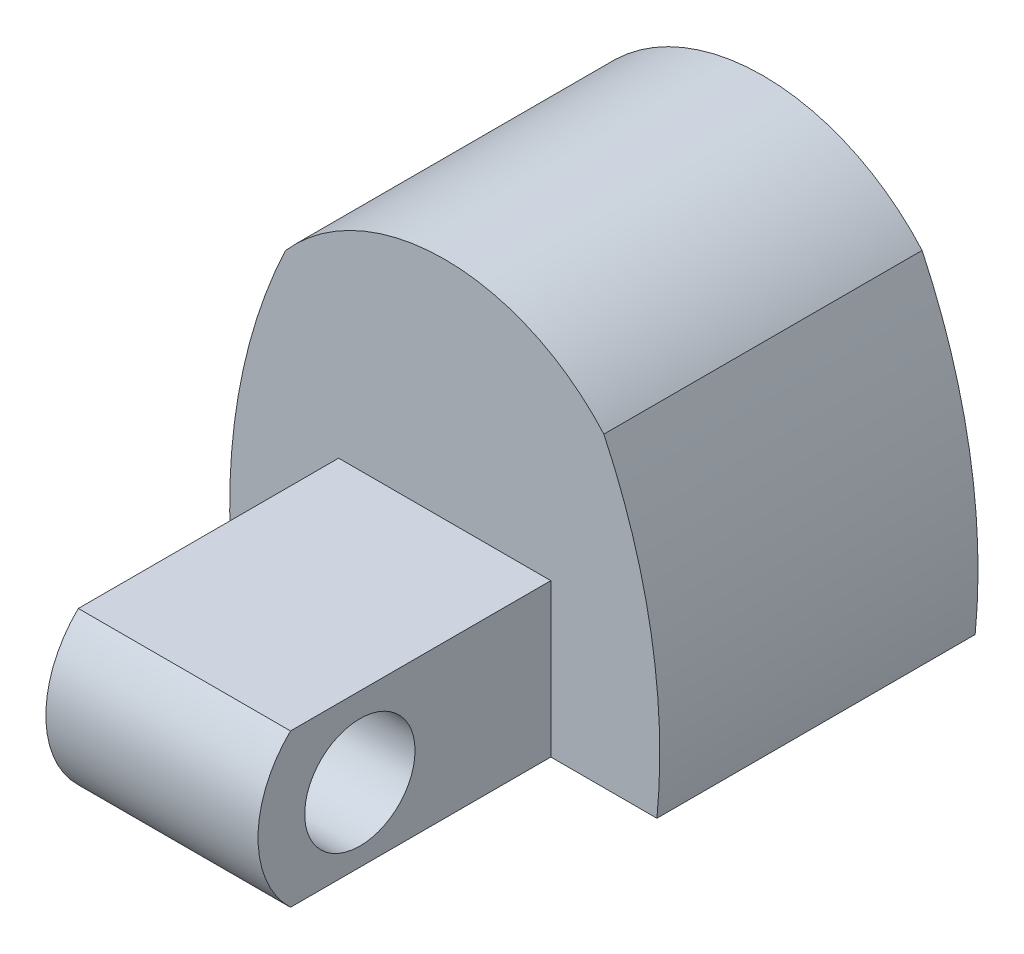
ISO-10303-21;
HEADER;
FILE_DESCRIPTION(('STEP AP214'),'2;1');
FILE_NAME('part.step','',(''),(''),'','','');
FILE_SCHEMA(('AUTOMOTIVE_DESIGN { 1 0 10303 214 1 1 1 1 }'));
ENDSEC;
DATA;
#1=APPLICATION_CONTEXT('core data for automotive mechanical design processes');
#2=APPLICATION_PROTOCOL_DEFINITION('international standard','automotive_design',2000,#1);
#3=PRODUCT_CONTEXT('',#1,'mechanical');
#4=PRODUCT('Part','Part','',(#3));
#5=PRODUCT_RELATED_PRODUCT_CATEGORY('part','',(#4));
#6=PRODUCT_DEFINITION_FORMATION('','',#4);
#7=PRODUCT_DEFINITION_CONTEXT('part definition',#1,'design');
#8=PRODUCT_DEFINITION('design','',#6,#7);
#9=PRODUCT_DEFINITION_SHAPE('','',#8);
#10=(LENGTH_UNIT() NAMED_UNIT(*) SI_UNIT(.MILLI.,.METRE.));
#11=(NAMED_UNIT(*) PLANE_ANGLE_UNIT() SI_UNIT($,.RADIAN.));
#12=(NAMED_UNIT(*) SI_UNIT($,.STERADIAN.) SOLID_ANGLE_UNIT());
#13=UNCERTAINTY_MEASURE_WITH_UNIT(LENGTH_MEASURE(1.E-05),#10,'distance_accuracy_value','');
#14=(GEOMETRIC_REPRESENTATION_CONTEXT(3) GLOBAL_UNCERTAINTY_ASSIGNED_CONTEXT((#13)) GLOBAL_UNIT_ASSIGNED_CONTEXT((#10,
#11,#12)) REPRESENTATION_CONTEXT('',''));
#15=CARTESIAN_POINT('',(0.,0.,0.));
#16=DIRECTION('',(0.,0.,1.));
#17=DIRECTION('',(1.,0.,0.));
#18=AXIS2_PLACEMENT_3D('',#15,#16,#17);
#19=CARTESIAN_POINT('',(0.,0.,15.));
#20=DIRECTION('',(0.,0.,1.));
#21=DIRECTION('',(1.,0.,0.));
#22=AXIS2_PLACEMENT_3D('',#19,#20,#21);
#23=PLANE('',#22);
#24=DIRECTION('',(-1.,0.,0.));
#25=VECTOR('',#24,1.);
#26=CARTESIAN_POINT('',(0.,0.,15.));
#27=LINE('',#26,#25);
#28=CARTESIAN_POINT('',(-5.,0.,15.));
#29=VERTEX_POINT('',#28);
#30=CARTESIAN_POINT('',(-10.,0.,15.));
#31=VERTEX_POINT('',#30);
#32=EDGE_CURVE('E127',#29,#31,#27,.T.);
#33=ORIENTED_EDGE('',*,*,#32,.F.);
#34=DIRECTION('',(0.,1.,0.));
#35=VECTOR('',#34,1.);
#36=CARTESIAN_POINT('',(-5.,7.2,15.));
#37=LINE('',#36,#35);
#38=CARTESIAN_POINT('',(-5.,7.2,15.));
#39=VERTEX_POINT('',#38);
#40=EDGE_CURVE('E122',#29,#39,#37,.T.);
#41=ORIENTED_EDGE('',*,*,#40,.T.);
#42=DIRECTION('',(-1.,0.,0.));
#43=VECTOR('',#42,1.);
#44=CARTESIAN_POINT('',(5.,7.2,15.));
#45=LINE('',#44,#43);
#46=CARTESIAN_POINT('',(5.,7.2,15.));
#47=VERTEX_POINT('',#46);
#48=EDGE_CURVE('E224',#47,#39,#45,.T.);
#49=ORIENTED_EDGE('',*,*,#48,.F.);
#50=DIRECTION('',(0.,1.,0.));
#51=VECTOR('',#50,1.);
#52=CARTESIAN_POINT('',(5.,7.2,15.));
#53=LINE('',#52,#51);
#54=CARTESIAN_POINT('',(5.,0.,15.));
#55=VERTEX_POINT('',#54);
#56=EDGE_CURVE('E249',#55,#47,#53,.T.);
#57=ORIENTED_EDGE('',*,*,#56,.F.);
#58=CARTESIAN_POINT('',(10.,0.,15.));
#59=VERTEX_POINT('',#58);
#60=EDGE_CURVE('E403',#59,#55,#27,.T.);
#61=ORIENTED_EDGE('',*,*,#60,.F.);
#62=CARTESIAN_POINT('',(-17.2247633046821,2.71486775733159,15.));
#63=DIRECTION('',(0.,0.,1.));
#64=DIRECTION('',(1.,0.,0.));
#65=AXIS2_PLACEMENT_3D('',#62,#63,#64);
#66=CIRCLE('',#65,27.3597924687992);
#67=CARTESIAN_POINT('',(7.5,14.43,15.));
#68=VERTEX_POINT('',#67);
#69=EDGE_CURVE('E398',#68,#59,#66,.F.);
#70=ORIENTED_EDGE('',*,*,#69,.F.);
#71=CARTESIAN_POINT('',(0.,7.81562172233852,15.));
#72=DIRECTION('',(0.,0.,1.));
#73=DIRECTION('',(1.,0.,0.));
#74=AXIS2_PLACEMENT_3D('',#71,#72,#73);
#75=CIRCLE('',#74,10.);
#76=CARTESIAN_POINT('',(-7.5,14.43,15.));
#77=VERTEX_POINT('',#76);
#78=EDGE_CURVE('E394',#77,#68,#75,.F.);
#79=ORIENTED_EDGE('',*,*,#78,.F.);
#80=CARTESIAN_POINT('',(17.2247633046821,2.7148677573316,15.));
#81=DIRECTION('',(0.,0.,1.));
#82=DIRECTION('',(1.,0.,0.));
#83=AXIS2_PLACEMENT_3D('',#80,#81,#82);
#84=CIRCLE('',#83,27.3597924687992);
#85=EDGE_CURVE('E371',#77,#31,#84,.T.);
#86=ORIENTED_EDGE('',*,*,#85,.T.);
#87=EDGE_LOOP('',(#33,#41,#49,#57,#61,#70,#79,#86));
#88=FACE_BOUND('',#87,.T.);
#89=ADVANCED_FACE('F106',(#88),#23,.T.);
#90=CARTESIAN_POINT('',(0.,7.81562172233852,15.));
#91=DIRECTION('',(0.,0.,-1.));
#92=DIRECTION('',(-1.,0.,0.));
#93=AXIS2_PLACEMENT_3D('',#90,#91,#92);
#94=CYLINDRICAL_SURFACE('',#93,10.);
#95=CARTESIAN_POINT('',(0.,7.81562172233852,0.));
#96=DIRECTION('',(0.,0.,1.));
#97=DIRECTION('',(1.,0.,0.));
#98=AXIS2_PLACEMENT_3D('',#95,#96,#97);
#99=CIRCLE('',#98,10.);
#100=CARTESIAN_POINT('',(-7.5,14.43,0.));
#101=VERTEX_POINT('',#100);
#102=CARTESIAN_POINT('',(7.5,14.43,0.));
#103=VERTEX_POINT('',#102);
#104=EDGE_CURVE('E412',#101,#103,#99,.F.);
#105=ORIENTED_EDGE('',*,*,#104,.F.);
#106=DIRECTION('',(0.,0.,-1.));
#107=VECTOR('',#106,1.);
#108=CARTESIAN_POINT('',(-7.5,14.43,15.));
#109=LINE('',#108,#107);
#110=EDGE_CURVE('E366',#77,#101,#109,.T.);
#111=ORIENTED_EDGE('',*,*,#110,.F.);
#112=ORIENTED_EDGE('',*,*,#78,.T.);
#113=DIRECTION('',(0.,0.,-1.));
#114=VECTOR('',#113,1.);
#115=CARTESIAN_POINT('',(7.5,14.43,15.));
#116=LINE('',#115,#114);
#117=EDGE_CURVE('E391',#68,#103,#116,.T.);
#118=ORIENTED_EDGE('',*,*,#117,.T.);
#119=EDGE_LOOP('',(#105,#111,#112,#118));
#120=FACE_BOUND('',#119,.T.);
#121=ADVANCED_FACE('F341',(#120),#94,.T.);
#122=CARTESIAN_POINT('',(0.,0.,0.));
#123=DIRECTION('',(0.,0.,1.));
#124=DIRECTION('',(1.,0.,0.));
#125=AXIS2_PLACEMENT_3D('',#122,#123,#124);
#126=PLANE('',#125);
#127=CARTESIAN_POINT('',(-2.91262946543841,3.85884071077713,0.));
#128=DIRECTION('',(0.,0.,-1.));
#129=DIRECTION('',(-1.,0.,0.));
#130=AXIS2_PLACEMENT_3D('',#127,#128,#129);
#131=CIRCLE('',#130,12.);
#132=CARTESIAN_POINT('',(0.,15.5,0.));
#133=VERTEX_POINT('',#132);
#134=CARTESIAN_POINT('',(8.45,0.,0.));
#135=VERTEX_POINT('',#134);
#136=EDGE_CURVE('E429',#133,#135,#131,.T.);
#137=ORIENTED_EDGE('',*,*,#136,.F.);
#138=CARTESIAN_POINT('',(2.91262946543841,3.85884071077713,0.));
#139=DIRECTION('',(0.,0.,-1.));
#140=DIRECTION('',(1.,0.,0.));
#141=AXIS2_PLACEMENT_3D('',#138,#139,#140);
#142=CIRCLE('',#141,12.);
#143=CARTESIAN_POINT('',(-8.45,0.,0.));
#144=VERTEX_POINT('',#143);
#145=EDGE_CURVE('E433',#144,#133,#142,.T.);
#146=ORIENTED_EDGE('',*,*,#145,.F.);
#147=DIRECTION('',(-1.,0.,0.));
#148=VECTOR('',#147,1.);
#149=CARTESIAN_POINT('',(0.,0.,0.));
#150=LINE('',#149,#148);
#151=CARTESIAN_POINT('',(-10.,0.,0.));
#152=VERTEX_POINT('',#151);
#153=EDGE_CURVE('E376',#144,#152,#150,.T.);
#154=ORIENTED_EDGE('',*,*,#153,.T.);
#155=CARTESIAN_POINT('',(17.2247633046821,2.7148677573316,0.));
#156=DIRECTION('',(0.,0.,1.));
#157=DIRECTION('',(1.,0.,0.));
#158=AXIS2_PLACEMENT_3D('',#155,#156,#157);
#159=CIRCLE('',#158,27.3597924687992);
#160=EDGE_CURVE('E362',#101,#152,#159,.T.);
#161=ORIENTED_EDGE('',*,*,#160,.F.);
#162=ORIENTED_EDGE('',*,*,#104,.T.);
#163=CARTESIAN_POINT('',(-17.2247633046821,2.71486775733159,0.));
#164=DIRECTION('',(0.,0.,1.));
#165=DIRECTION('',(1.,0.,0.));
#166=AXIS2_PLACEMENT_3D('',#163,#164,#165);
#167=CIRCLE('',#166,27.3597924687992);
#168=CARTESIAN_POINT('',(10.,0.,0.));
#169=VERTEX_POINT('',#168);
#170=EDGE_CURVE('E378',#103,#169,#167,.F.);
#171=ORIENTED_EDGE('',*,*,#170,.T.);
#172=EDGE_CURVE('E402',#169,#135,#150,.T.);
#173=ORIENTED_EDGE('',*,*,#172,.T.);
#174=EDGE_LOOP('',(#137,#146,#154,#161,#162,#171,#173));
#175=FACE_BOUND('',#174,.T.);
#176=ADVANCED_FACE('F337',(#175),#126,.F.);
#177=CARTESIAN_POINT('',(0.,0.,15.));
#178=DIRECTION('',(0.,-1.,0.));
#179=DIRECTION('',(1.,0.,0.));
#180=AXIS2_PLACEMENT_3D('',#177,#178,#179);
#181=PLANE('',#180);
#182=DIRECTION('',(0.,0.,-1.));
#183=VECTOR('',#182,1.);
#184=CARTESIAN_POINT('',(-8.45,0.,12.));
#185=LINE('',#184,#183);
#186=CARTESIAN_POINT('',(-8.45,0.,12.));
#187=VERTEX_POINT('',#186);
#188=EDGE_CURVE('E372',#187,#144,#185,.T.);
#189=ORIENTED_EDGE('',*,*,#188,.F.);
#190=DIRECTION('',(-1.,0.,0.));
#191=VECTOR('',#190,1.);
#192=CARTESIAN_POINT('',(8.45,0.,12.));
#193=LINE('',#192,#191);
#194=CARTESIAN_POINT('',(8.45,0.,12.));
#195=VERTEX_POINT('',#194);
#196=EDGE_CURVE('E423',#195,#187,#193,.T.);
#197=ORIENTED_EDGE('',*,*,#196,.F.);
#198=DIRECTION('',(0.,0.,-1.));
#199=VECTOR('',#198,1.);
#200=CARTESIAN_POINT('',(8.45,0.,12.));
#201=LINE('',#200,#199);
#202=EDGE_CURVE('E422',#195,#135,#201,.T.);
#203=ORIENTED_EDGE('',*,*,#202,.T.);
#204=ORIENTED_EDGE('',*,*,#172,.F.);
#205=DIRECTION('',(0.,0.,-1.));
#206=VECTOR('',#205,1.);
#207=CARTESIAN_POINT('',(10.,0.,15.));
#208=LINE('',#207,#206);
#209=EDGE_CURVE('E406',#59,#169,#208,.T.);
#210=ORIENTED_EDGE('',*,*,#209,.F.);
#211=ORIENTED_EDGE('',*,*,#60,.T.);
#212=DIRECTION('',(0.,0.,-1.));
#213=VECTOR('',#212,1.);
#214=CARTESIAN_POINT('',(5.,0.,15.));
#215=LINE('',#214,#213);
#216=CARTESIAN_POINT('',(5.,0.,27.2698703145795));
#217=VERTEX_POINT('',#216);
#218=EDGE_CURVE('E258',#217,#55,#215,.T.);
#219=ORIENTED_EDGE('',*,*,#218,.F.);
#220=DIRECTION('',(-1.,0.,0.));
#221=VECTOR('',#220,1.);
#222=CARTESIAN_POINT('',(5.,0.,27.2698703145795));
#223=LINE('',#222,#221);
#224=CARTESIAN_POINT('',(-5.,0.,27.2698703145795));
#225=VERTEX_POINT('',#224);
#226=EDGE_CURVE('E225',#217,#225,#223,.T.);
#227=ORIENTED_EDGE('',*,*,#226,.T.);
#228=DIRECTION('',(0.,0.,-1.));
#229=VECTOR('',#228,1.);
#230=CARTESIAN_POINT('',(-5.,0.,15.));
#231=LINE('',#230,#229);
#232=EDGE_CURVE('E232',#225,#29,#231,.T.);
#233=ORIENTED_EDGE('',*,*,#232,.T.);
#234=ORIENTED_EDGE('',*,*,#32,.T.);
#235=DIRECTION('',(0.,0.,-1.));
#236=VECTOR('',#235,1.);
#237=CARTESIAN_POINT('',(-10.,0.,15.));
#238=LINE('',#237,#236);
#239=EDGE_CURVE('E365',#31,#152,#238,.T.);
#240=ORIENTED_EDGE('',*,*,#239,.T.);
#241=ORIENTED_EDGE('',*,*,#153,.F.);
#242=EDGE_LOOP('',(#189,#197,#203,#204,#210,#211,#219,#227,#233,#234,#240,#241));
#243=FACE_BOUND('',#242,.T.);
#244=ADVANCED_FACE('F349',(#243),#181,.T.);
#245=CARTESIAN_POINT('',(17.2247633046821,2.7148677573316,15.));
#246=DIRECTION('',(0.,0.,-1.));
#247=DIRECTION('',(-1.,0.,0.));
#248=AXIS2_PLACEMENT_3D('',#245,#246,#247);
#249=CYLINDRICAL_SURFACE('',#248,27.3597924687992);
#250=ORIENTED_EDGE('',*,*,#160,.T.);
#251=ORIENTED_EDGE('',*,*,#239,.F.);
#252=ORIENTED_EDGE('',*,*,#85,.F.);
#253=ORIENTED_EDGE('',*,*,#110,.T.);
#254=EDGE_LOOP('',(#250,#251,#252,#253));
#255=FACE_BOUND('',#254,.T.);
#256=ADVANCED_FACE('F108',(#255),#249,.T.);
#257=CARTESIAN_POINT('',(-17.2247633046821,2.71486775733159,15.));
#258=DIRECTION('',(0.,0.,-1.));
#259=DIRECTION('',(-1.,0.,0.));
#260=AXIS2_PLACEMENT_3D('',#257,#258,#259);
#261=CYLINDRICAL_SURFACE('',#260,27.3597924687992);
#262=ORIENTED_EDGE('',*,*,#170,.F.);
#263=ORIENTED_EDGE('',*,*,#117,.F.);
#264=ORIENTED_EDGE('',*,*,#69,.T.);
#265=ORIENTED_EDGE('',*,*,#209,.T.);
#266=EDGE_LOOP('',(#262,#263,#264,#265));
#267=FACE_BOUND('',#266,.T.);
#268=ADVANCED_FACE('F335',(#267),#261,.T.);
#269=CARTESIAN_POINT('',(2.91262946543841,3.85884071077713,12.));
#270=DIRECTION('',(0.,0.,-1.));
#271=DIRECTION('',(-1.,0.,0.));
#272=AXIS2_PLACEMENT_3D('',#269,#270,#271);
#273=CYLINDRICAL_SURFACE('',#272,12.);
#274=DIRECTION('',(0.,0.,-1.));
#275=VECTOR('',#274,1.);
#276=CARTESIAN_POINT('',(-9.,2.41341370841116,12.));
#277=LINE('',#276,#275);
#278=CARTESIAN_POINT('',(-9.,2.41341370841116,0.79915953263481));
#279=VERTEX_POINT('',#278);
#280=CARTESIAN_POINT('',(-9.,2.41341370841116,4.20084046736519));
#281=VERTEX_POINT('',#280);
#282=EDGE_CURVE('E12',#279,#281,#277,.F.);
#283=ORIENTED_EDGE('',*,*,#282,.F.);
#284=CARTESIAN_POINT('',(-9.,2.41341370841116,0.79915953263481));
#285=CARTESIAN_POINT('',(-8.99417385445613,2.36538903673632,0.828870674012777));
#286=CARTESIAN_POINT('',(-8.9882079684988,2.31865850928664,0.860593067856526));
#287=CARTESIAN_POINT('',(-8.9761312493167,2.22805777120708,0.927860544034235));
#288=CARTESIAN_POINT('',(-8.97002042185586,2.18418744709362,0.963405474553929));
#289=CARTESIAN_POINT('',(-8.95168382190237,2.05735379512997,1.07540346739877));
#290=CARTESIAN_POINT('',(-8.93944174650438,1.97907069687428,1.15727993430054));
#291=CARTESIAN_POINT('',(-8.91609684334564,1.83735082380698,1.33316145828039));
#292=CARTESIAN_POINT('',(-8.90499465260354,1.77392232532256,1.42717323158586));
#293=CARTESIAN_POINT('',(-8.88503229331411,1.66377393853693,1.62471791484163));
#294=CARTESIAN_POINT('',(-8.87617122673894,1.617047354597,1.72824698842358));
#295=CARTESIAN_POINT('',(-8.86165640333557,1.54202116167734,1.9410775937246));
#296=CARTESIAN_POINT('',(-8.85597804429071,1.5135799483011,2.05032750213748));
#297=CARTESIAN_POINT('',(-8.84831617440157,1.47545170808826,2.27220204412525));
#298=CARTESIAN_POINT('',(-8.84633308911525,1.46576684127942,2.38482706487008));
#299=CARTESIAN_POINT('',(-8.84627494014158,1.46548232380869,2.60813500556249));
#300=CARTESIAN_POINT('',(-8.84813250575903,1.4745536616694,2.71881763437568));
#301=CARTESIAN_POINT('',(-8.8554264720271,1.51082094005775,2.93701700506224));
#302=CARTESIAN_POINT('',(-8.86086197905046,1.53801235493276,3.04453453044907));
#303=CARTESIAN_POINT('',(-8.87475417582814,1.60964004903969,3.25332480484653));
#304=CARTESIAN_POINT('',(-8.88320770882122,1.65405831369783,3.35460394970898));
#305=CARTESIAN_POINT('',(-8.90231099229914,1.75883744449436,3.54834890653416));
#306=CARTESIAN_POINT('',(-8.91296184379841,1.81920630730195,3.64081026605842));
#307=CARTESIAN_POINT('',(-8.93634655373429,1.95958111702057,3.82132116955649));
#308=CARTESIAN_POINT('',(-8.94917817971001,2.04075373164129,3.90845988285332));
#309=CARTESIAN_POINT('',(-8.96844827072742,2.17302139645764,4.02732499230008));
#310=CARTESIAN_POINT('',(-8.97488113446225,2.2189075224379,4.06500105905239));
#311=CARTESIAN_POINT('',(-8.98759413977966,2.3138560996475,4.13613851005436));
#312=CARTESIAN_POINT('',(-8.9938742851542,2.36291847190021,4.16959999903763));
#313=CARTESIAN_POINT('',(-9.,2.41341370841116,4.20084046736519));
#314=B_SPLINE_CURVE_WITH_KNOTS('',3,(#284,#285,#286,#287,#288,#289,#290,#291,#292,#293,#294,
#295,#296,#297,#298,#299,#300,#301,#302,#303,#304,#305,#306,#307,#308,#309,#310,#311,#312,#313),
.UNSPECIFIED.,.F.,.F.,(4,2,2,2,2,2,2,2,2,2,2,2,2,2,4),(0.,0.170210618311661,0.34041447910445,
0.680481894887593,1.02073833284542,1.3608582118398,1.69831137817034,2.03580340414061,
2.36742557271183,2.6989649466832,3.03015855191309,3.36151851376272,3.71879790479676,
3.89775583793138,4.07670932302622),.UNSPECIFIED.);
#315=EDGE_CURVE('E284',#279,#281,#314,.T.);
#316=ORIENTED_EDGE('',*,*,#315,.T.);
#317=EDGE_LOOP('',(#283,#316));
#318=FACE_BOUND('',#317,.T.);
#319=DIRECTION('',(0.,0.,-1.));
#320=VECTOR('',#319,1.);
#321=CARTESIAN_POINT('',(-9.,5.30426771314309,12.));
#322=LINE('',#321,#320);
#323=CARTESIAN_POINT('',(-9.,5.30426771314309,3.2870075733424));
#324=VERTEX_POINT('',#323);
#325=CARTESIAN_POINT('',(-9.,5.30426771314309,1.7129924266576));
#326=VERTEX_POINT('',#325);
#327=EDGE_CURVE('E115',#324,#326,#322,.T.);
#328=ORIENTED_EDGE('',*,*,#327,.F.);
#329=CARTESIAN_POINT('',(-9.,5.30426771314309,3.2870075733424));
#330=CARTESIAN_POINT('',(-8.99733442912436,5.32622377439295,3.23571067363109));
#331=CARTESIAN_POINT('',(-8.99487183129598,5.3460264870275,3.18351035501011));
#332=CARTESIAN_POINT('',(-8.99042544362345,5.38120858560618,3.07761912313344));
#333=CARTESIAN_POINT('',(-8.98844166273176,5.39658788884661,3.02392818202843));
#334=CARTESIAN_POINT('',(-8.98332019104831,5.43589766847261,2.86116693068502));
#335=CARTESIAN_POINT('',(-8.98100873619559,5.4530287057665,2.75034103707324));
#336=CARTESIAN_POINT('',(-8.97891565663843,5.46856505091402,2.52733582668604));
#337=CARTESIAN_POINT('',(-8.97913623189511,5.46695407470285,2.41515541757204));
#338=CARTESIAN_POINT('',(-8.98208077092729,5.44502893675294,2.19278256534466));
#339=CARTESIAN_POINT('',(-8.98480050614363,5.42474636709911,2.08258708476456));
#340=CARTESIAN_POINT('',(-8.99014666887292,5.38332689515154,1.93029385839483));
#341=CARTESIAN_POINT('',(-8.99189883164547,5.36961576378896,1.88603295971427));
#342=CARTESIAN_POINT('',(-8.99572157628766,5.33918211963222,1.79864104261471));
#343=CARTESIAN_POINT('',(-8.99779171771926,5.32246376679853,1.75550855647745));
#344=CARTESIAN_POINT('',(-9.,5.30426771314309,1.7129924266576));
#345=B_SPLINE_CURVE_WITH_KNOTS('',3,(#329,#330,#331,#332,#333,#334,#335,#336,#337,#338,#339,
#340,#341,#342,#343,#344),.UNSPECIFIED.,.F.,.F.,(4,2,2,2,2,2,2,4),(0.,0.167483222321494,
0.334969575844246,0.669725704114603,1.00477270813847,1.33925385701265,1.47827065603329,
1.61709660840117),.UNSPECIFIED.);
#346=EDGE_CURVE('E275',#324,#326,#345,.T.);
#347=ORIENTED_EDGE('',*,*,#346,.T.);
#348=EDGE_LOOP('',(#328,#347));
#349=FACE_BOUND('',#348,.T.);
#350=ORIENTED_EDGE('',*,*,#145,.T.);
#351=DIRECTION('',(0.,0.,-1.));
#352=VECTOR('',#351,1.);
#353=CARTESIAN_POINT('',(0.,15.5,12.));
#354=LINE('',#353,#352);
#355=CARTESIAN_POINT('',(0.,15.5,12.));
#356=VERTEX_POINT('',#355);
#357=EDGE_CURVE('E419',#356,#133,#354,.T.);
#358=ORIENTED_EDGE('',*,*,#357,.F.);
#359=CARTESIAN_POINT('',(2.91262946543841,3.85884071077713,12.));
#360=DIRECTION('',(0.,0.,-1.));
#361=DIRECTION('',(1.,0.,0.));
#362=AXIS2_PLACEMENT_3D('',#359,#360,#361);
#363=CIRCLE('',#362,12.);
#364=EDGE_CURVE('E432',#187,#356,#363,.T.);
#365=ORIENTED_EDGE('',*,*,#364,.F.);
#366=ORIENTED_EDGE('',*,*,#188,.T.);
#367=EDGE_LOOP('',(#350,#358,#365,#366));
#368=FACE_BOUND('',#367,.T.);
#369=ADVANCED_FACE('F290',(#318,#349,#368),#273,.F.);
#370=CARTESIAN_POINT('',(-2.91262946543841,3.85884071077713,12.));
#371=DIRECTION('',(0.,0.,-1.));
#372=DIRECTION('',(-1.,0.,0.));
#373=AXIS2_PLACEMENT_3D('',#370,#371,#372);
#374=CYLINDRICAL_SURFACE('',#373,12.);
#375=DIRECTION('',(0.,0.,-1.));
#376=VECTOR('',#375,1.);
#377=CARTESIAN_POINT('',(9.,2.41341370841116,12.));
#378=LINE('',#377,#376);
#379=CARTESIAN_POINT('',(9.,2.41341370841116,0.79915953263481));
#380=VERTEX_POINT('',#379);
#381=CARTESIAN_POINT('',(9.,2.41341370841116,4.20084046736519));
#382=VERTEX_POINT('',#381);
#383=EDGE_CURVE('E323',#380,#382,#378,.F.);
#384=ORIENTED_EDGE('',*,*,#383,.T.);
#385=CARTESIAN_POINT('',(9.,2.41341370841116,4.20084046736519));
#386=CARTESIAN_POINT('',(8.99417385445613,2.36538903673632,4.17112932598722));
#387=CARTESIAN_POINT('',(8.9882079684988,2.31865850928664,4.13940693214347));
#388=CARTESIAN_POINT('',(8.9761312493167,2.22805777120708,4.07213945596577));
#389=CARTESIAN_POINT('',(8.97002042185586,2.18418744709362,4.03659452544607));
#390=CARTESIAN_POINT('',(8.95168382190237,2.05735379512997,3.92459653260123));
#391=CARTESIAN_POINT('',(8.93944174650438,1.97907069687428,3.84272006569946));
#392=CARTESIAN_POINT('',(8.91609684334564,1.83735082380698,3.66683854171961));
#393=CARTESIAN_POINT('',(8.90499465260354,1.77392232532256,3.57282676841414));
#394=CARTESIAN_POINT('',(8.88503229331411,1.66377393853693,3.37528208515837));
#395=CARTESIAN_POINT('',(8.87617122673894,1.617047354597,3.27175301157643));
#396=CARTESIAN_POINT('',(8.86165640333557,1.54202116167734,3.05892240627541));
#397=CARTESIAN_POINT('',(8.85597804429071,1.5135799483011,2.94967249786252));
#398=CARTESIAN_POINT('',(8.84831617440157,1.47545170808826,2.72779795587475));
#399=CARTESIAN_POINT('',(8.84633308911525,1.46576684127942,2.61517293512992));
#400=CARTESIAN_POINT('',(8.84627494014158,1.46548232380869,2.39186499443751));
#401=CARTESIAN_POINT('',(8.84813250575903,1.4745536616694,2.28118236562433));
#402=CARTESIAN_POINT('',(8.8554264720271,1.51082094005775,2.06298299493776));
#403=CARTESIAN_POINT('',(8.86086197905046,1.53801235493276,1.95546546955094));
#404=CARTESIAN_POINT('',(8.87475417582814,1.60964004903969,1.74667519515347));
#405=CARTESIAN_POINT('',(8.88320770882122,1.65405831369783,1.64539605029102));
#406=CARTESIAN_POINT('',(8.90231099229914,1.75883744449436,1.45165109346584));
#407=CARTESIAN_POINT('',(8.91296184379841,1.81920630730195,1.35918973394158));
#408=CARTESIAN_POINT('',(8.93634655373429,1.95958111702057,1.17867883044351));
#409=CARTESIAN_POINT('',(8.94917817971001,2.04075373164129,1.09154011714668));
#410=CARTESIAN_POINT('',(8.96844827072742,2.17302139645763,0.972675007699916));
#411=CARTESIAN_POINT('',(8.97488113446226,2.2189075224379,0.93499894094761));
#412=CARTESIAN_POINT('',(8.98759413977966,2.3138560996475,0.863861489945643));
#413=CARTESIAN_POINT('',(8.9938742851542,2.36291847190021,0.830400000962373));
#414=CARTESIAN_POINT('',(9.,2.41341370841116,0.79915953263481));
#415=B_SPLINE_CURVE_WITH_KNOTS('',3,(#385,#386,#387,#388,#389,#390,#391,#392,#393,#394,#395,
#396,#397,#398,#399,#400,#401,#402,#403,#404,#405,#406,#407,#408,#409,#410,#411,#412,#413,#414),
.UNSPECIFIED.,.F.,.F.,(4,2,2,2,2,2,2,2,2,2,2,2,2,2,4),(0.,0.17021061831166,0.340414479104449,
0.680481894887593,1.02073833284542,1.3608582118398,1.69831137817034,2.03580340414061,
2.36742557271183,2.69896494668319,3.03015855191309,3.36151851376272,3.71879790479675,
3.89775583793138,4.07670932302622),.UNSPECIFIED.);
#416=EDGE_CURVE('E316',#382,#380,#415,.T.);
#417=ORIENTED_EDGE('',*,*,#416,.T.);
#418=EDGE_LOOP('',(#384,#417));
#419=FACE_BOUND('',#418,.T.);
#420=DIRECTION('',(0.,0.,-1.));
#421=VECTOR('',#420,1.);
#422=CARTESIAN_POINT('',(9.,5.30426771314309,12.));
#423=LINE('',#422,#421);
#424=CARTESIAN_POINT('',(9.,5.30426771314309,3.2870075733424));
#425=VERTEX_POINT('',#424);
#426=CARTESIAN_POINT('',(9.,5.30426771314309,1.7129924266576));
#427=VERTEX_POINT('',#426);
#428=EDGE_CURVE('E385',#425,#427,#423,.T.);
#429=ORIENTED_EDGE('',*,*,#428,.T.);
#430=CARTESIAN_POINT('',(9.,5.30426771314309,1.7129924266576));
#431=CARTESIAN_POINT('',(8.99733442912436,5.32622377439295,1.76428932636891));
#432=CARTESIAN_POINT('',(8.99487183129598,5.3460264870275,1.81648964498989));
#433=CARTESIAN_POINT('',(8.99042544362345,5.38120858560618,1.92238087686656));
#434=CARTESIAN_POINT('',(8.98844166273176,5.39658788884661,1.97607181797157));
#435=CARTESIAN_POINT('',(8.98332019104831,5.43589766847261,2.13883306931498));
#436=CARTESIAN_POINT('',(8.98100873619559,5.4530287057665,2.24965896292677));
#437=CARTESIAN_POINT('',(8.97891565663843,5.46856505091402,2.47266417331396));
#438=CARTESIAN_POINT('',(8.97913623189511,5.46695407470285,2.58484458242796));
#439=CARTESIAN_POINT('',(8.98208077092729,5.44502893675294,2.80721743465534));
#440=CARTESIAN_POINT('',(8.98480050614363,5.42474636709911,2.91741291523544));
#441=CARTESIAN_POINT('',(8.99014666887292,5.38332689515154,3.06970614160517));
#442=CARTESIAN_POINT('',(8.99189883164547,5.36961576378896,3.11396704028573));
#443=CARTESIAN_POINT('',(8.99572157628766,5.33918211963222,3.20135895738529));
#444=CARTESIAN_POINT('',(8.99779171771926,5.32246376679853,3.24449144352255));
#445=CARTESIAN_POINT('',(9.,5.30426771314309,3.2870075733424));
#446=B_SPLINE_CURVE_WITH_KNOTS('',3,(#430,#431,#432,#433,#434,#435,#436,#437,#438,#439,#440,
#441,#442,#443,#444,#445),.UNSPECIFIED.,.F.,.F.,(4,2,2,2,2,2,2,4),(0.,0.167483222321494,
0.334969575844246,0.669725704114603,1.00477270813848,1.33925385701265,1.47827065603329,
1.61709660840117),.UNSPECIFIED.);
#447=EDGE_CURVE('E307',#427,#425,#446,.T.);
#448=ORIENTED_EDGE('',*,*,#447,.T.);
#449=EDGE_LOOP('',(#429,#448));
#450=FACE_BOUND('',#449,.T.);
#451=ORIENTED_EDGE('',*,*,#136,.T.);
#452=ORIENTED_EDGE('',*,*,#202,.F.);
#453=CARTESIAN_POINT('',(-2.91262946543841,3.85884071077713,12.));
#454=DIRECTION('',(0.,0.,-1.));
#455=DIRECTION('',(-1.,0.,0.));
#456=AXIS2_PLACEMENT_3D('',#453,#454,#455);
#457=CIRCLE('',#456,12.);
#458=EDGE_CURVE('E440',#356,#195,#457,.T.);
#459=ORIENTED_EDGE('',*,*,#458,.F.);
#460=ORIENTED_EDGE('',*,*,#357,.T.);
#461=EDGE_LOOP('',(#451,#452,#459,#460));
#462=FACE_BOUND('',#461,.T.);
#463=ADVANCED_FACE('F324',(#419,#450,#462),#374,.F.);
#464=CARTESIAN_POINT('',(2.91262946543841,3.85884071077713,12.));
#465=DIRECTION('',(0.,0.,1.));
#466=DIRECTION('',(1.,0.,0.));
#467=AXIS2_PLACEMENT_3D('',#464,#465,#466);
#468=PLANE('',#467);
#469=ORIENTED_EDGE('',*,*,#364,.T.);
#470=ORIENTED_EDGE('',*,*,#458,.T.);
#471=ORIENTED_EDGE('',*,*,#196,.T.);
#472=EDGE_LOOP('',(#469,#470,#471));
#473=FACE_BOUND('',#472,.T.);
#474=ADVANCED_FACE('F303',(#473),#468,.F.);
#475=CARTESIAN_POINT('',(-9.,3.46562172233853,2.5));
#476=DIRECTION('',(1.,0.,0.));
#477=DIRECTION('',(0.,0.,-1.));
#478=AXIS2_PLACEMENT_3D('',#475,#476,#477);
#479=PLANE('',#478);
#480=CARTESIAN_POINT('',(-9.,3.46562172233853,2.5));
#481=DIRECTION('',(1.,0.,0.));
#482=DIRECTION('',(0.,0.,-1.));
#483=AXIS2_PLACEMENT_3D('',#480,#481,#482);
#484=CIRCLE('',#483,2.);
#485=EDGE_CURVE('E267',#279,#326,#484,.T.);
#486=ORIENTED_EDGE('',*,*,#485,.F.);
#487=ORIENTED_EDGE('',*,*,#282,.T.);
#488=EDGE_CURVE('E271',#324,#281,#484,.T.);
#489=ORIENTED_EDGE('',*,*,#488,.F.);
#490=ORIENTED_EDGE('',*,*,#327,.T.);
#491=EDGE_LOOP('',(#486,#487,#489,#490));
#492=FACE_BOUND('',#491,.T.);
#493=ADVANCED_FACE('F300',(#492),#479,.F.);
#494=CARTESIAN_POINT('',(-9.,3.46562172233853,2.5));
#495=DIRECTION('',(1.,0.,0.));
#496=DIRECTION('',(0.,0.,-1.));
#497=AXIS2_PLACEMENT_3D('',#494,#495,#496);
#498=CYLINDRICAL_SURFACE('',#497,2.);
#499=ORIENTED_EDGE('',*,*,#416,.F.);
#500=CARTESIAN_POINT('',(9.,3.46562172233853,2.5));
#501=DIRECTION('',(1.,0.,0.));
#502=DIRECTION('',(0.,0.,-1.));
#503=AXIS2_PLACEMENT_3D('',#500,#501,#502);
#504=CIRCLE('',#503,2.);
#505=EDGE_CURVE('E272',#425,#382,#504,.T.);
#506=ORIENTED_EDGE('',*,*,#505,.F.);
#507=ORIENTED_EDGE('',*,*,#447,.F.);
#508=EDGE_CURVE('E266',#380,#427,#504,.T.);
#509=ORIENTED_EDGE('',*,*,#508,.F.);
#510=EDGE_LOOP('',(#499,#506,#507,#509));
#511=FACE_BOUND('',#510,.T.);
#512=ORIENTED_EDGE('',*,*,#315,.F.);
#513=ORIENTED_EDGE('',*,*,#485,.T.);
#514=ORIENTED_EDGE('',*,*,#346,.F.);
#515=ORIENTED_EDGE('',*,*,#488,.T.);
#516=EDGE_LOOP('',(#512,#513,#514,#515));
#517=FACE_BOUND('',#516,.T.);
#518=ADVANCED_FACE('F294',(#511,#517),#498,.T.);
#519=CARTESIAN_POINT('',(9.,3.46562172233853,2.5));
#520=DIRECTION('',(1.,0.,0.));
#521=DIRECTION('',(0.,0.,-1.));
#522=AXIS2_PLACEMENT_3D('',#519,#520,#521);
#523=PLANE('',#522);
#524=ORIENTED_EDGE('',*,*,#383,.F.);
#525=ORIENTED_EDGE('',*,*,#508,.T.);
#526=ORIENTED_EDGE('',*,*,#428,.F.);
#527=ORIENTED_EDGE('',*,*,#505,.T.);
#528=EDGE_LOOP('',(#524,#525,#526,#527));
#529=FACE_BOUND('',#528,.T.);
#530=ADVANCED_FACE('F299',(#529),#523,.T.);
#531=CARTESIAN_POINT('',(5.,3.6,23.8));
#532=DIRECTION('',(-1.,0.,0.));
#533=DIRECTION('',(0.,0.,1.));
#534=AXIS2_PLACEMENT_3D('',#531,#532,#533);
#535=PLANE('',#534);
#536=ORIENTED_EDGE('',*,*,#56,.T.);
#537=DIRECTION('',(0.,0.,1.));
#538=VECTOR('',#537,1.);
#539=CARTESIAN_POINT('',(5.,7.2,27.2698703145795));
#540=LINE('',#539,#538);
#541=CARTESIAN_POINT('',(5.,7.2,27.2698703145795));
#542=VERTEX_POINT('',#541);
#543=EDGE_CURVE('E253',#47,#542,#540,.T.);
#544=ORIENTED_EDGE('',*,*,#543,.T.);
#545=CARTESIAN_POINT('',(5.,3.6,23.8));
#546=DIRECTION('',(1.,0.,0.));
#547=DIRECTION('',(0.,0.,1.));
#548=AXIS2_PLACEMENT_3D('',#545,#546,#547);
#549=CIRCLE('',#548,5.00000000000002);
#550=EDGE_CURVE('E219',#542,#217,#549,.T.);
#551=ORIENTED_EDGE('',*,*,#550,.T.);
#552=ORIENTED_EDGE('',*,*,#218,.T.);
#553=EDGE_LOOP('',(#536,#544,#551,#552));
#554=FACE_BOUND('',#553,.T.);
#555=CARTESIAN_POINT('',(5.,3.46562172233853,24.));
#556=DIRECTION('',(1.,0.,0.));
#557=DIRECTION('',(0.,0.,-1.));
#558=AXIS2_PLACEMENT_3D('',#555,#556,#557);
#559=CIRCLE('',#558,2.6);
#560=CARTESIAN_POINT('',(5.,3.46562172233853,21.4));
#561=VERTEX_POINT('',#560);
#562=EDGE_CURVE('E245',#561,#561,#559,.T.);
#563=ORIENTED_EDGE('',*,*,#562,.F.);
#564=EDGE_LOOP('',(#563));
#565=FACE_BOUND('',#564,.T.);
#566=ADVANCED_FACE('F457',(#554,#565),#535,.F.);
#567=CARTESIAN_POINT('',(5.,7.2,27.2698703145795));
#568=DIRECTION('',(0.,-1.,0.));
#569=DIRECTION('',(0.,0.,-1.));
#570=AXIS2_PLACEMENT_3D('',#567,#568,#569);
#571=PLANE('',#570);
#572=ORIENTED_EDGE('',*,*,#48,.T.);
#573=DIRECTION('',(0.,0.,1.));
#574=VECTOR('',#573,1.);
#575=CARTESIAN_POINT('',(-5.,7.2,27.2698703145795));
#576=LINE('',#575,#574);
#577=CARTESIAN_POINT('',(-5.,7.2,27.2698703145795));
#578=VERTEX_POINT('',#577);
#579=EDGE_CURVE('E230',#39,#578,#576,.T.);
#580=ORIENTED_EDGE('',*,*,#579,.T.);
#581=DIRECTION('',(-1.,0.,0.));
#582=VECTOR('',#581,1.);
#583=CARTESIAN_POINT('',(5.,7.2,27.2698703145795));
#584=LINE('',#583,#582);
#585=EDGE_CURVE('E213',#542,#578,#584,.T.);
#586=ORIENTED_EDGE('',*,*,#585,.F.);
#587=ORIENTED_EDGE('',*,*,#543,.F.);
#588=EDGE_LOOP('',(#572,#580,#586,#587));
#589=FACE_BOUND('',#588,.T.);
#590=ADVANCED_FACE('F235',(#589),#571,.F.);
#591=CARTESIAN_POINT('',(5.,3.6,23.8));
#592=DIRECTION('',(-1.,0.,0.));
#593=DIRECTION('',(0.,0.,1.));
#594=AXIS2_PLACEMENT_3D('',#591,#592,#593);
#595=CYLINDRICAL_SURFACE('',#594,5.00000000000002);
#596=ORIENTED_EDGE('',*,*,#585,.T.);
#597=CARTESIAN_POINT('',(-5.,3.6,23.8));
#598=DIRECTION('',(1.,0.,0.));
#599=DIRECTION('',(0.,0.,1.));
#600=AXIS2_PLACEMENT_3D('',#597,#598,#599);
#601=CIRCLE('',#600,5.00000000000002);
#602=EDGE_CURVE('E217',#578,#225,#601,.T.);
#603=ORIENTED_EDGE('',*,*,#602,.T.);
#604=ORIENTED_EDGE('',*,*,#226,.F.);
#605=ORIENTED_EDGE('',*,*,#550,.F.);
#606=EDGE_LOOP('',(#596,#603,#604,#605));
#607=FACE_BOUND('',#606,.T.);
#608=ADVANCED_FACE('F215',(#607),#595,.T.);
#609=CARTESIAN_POINT('',(5.,3.46562172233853,24.));
#610=DIRECTION('',(-1.,0.,0.));
#611=DIRECTION('',(0.,0.,1.));
#612=AXIS2_PLACEMENT_3D('',#609,#610,#611);
#613=CYLINDRICAL_SURFACE('',#612,2.6);
#614=ORIENTED_EDGE('',*,*,#562,.T.);
#615=EDGE_LOOP('',(#614));
#616=FACE_BOUND('',#615,.T.);
#617=CARTESIAN_POINT('',(-5.,3.46562172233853,24.));
#618=DIRECTION('',(1.,0.,0.));
#619=DIRECTION('',(0.,0.,-1.));
#620=AXIS2_PLACEMENT_3D('',#617,#618,#619);
#621=CIRCLE('',#620,2.6);
#622=CARTESIAN_POINT('',(-5.,3.46562172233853,21.4));
#623=VERTEX_POINT('',#622);
#624=EDGE_CURVE('E239',#623,#623,#621,.T.);
#625=ORIENTED_EDGE('',*,*,#624,.F.);
#626=EDGE_LOOP('',(#625));
#627=FACE_BOUND('',#626,.T.);
#628=ADVANCED_FACE('F463',(#616,#627),#613,.F.);
#629=CARTESIAN_POINT('',(-5.,3.6,23.8));
#630=DIRECTION('',(-1.,0.,0.));
#631=DIRECTION('',(0.,0.,1.));
#632=AXIS2_PLACEMENT_3D('',#629,#630,#631);
#633=PLANE('',#632);
#634=ORIENTED_EDGE('',*,*,#624,.T.);
#635=EDGE_LOOP('',(#634));
#636=FACE_BOUND('',#635,.T.);
#637=ORIENTED_EDGE('',*,*,#40,.F.);
#638=ORIENTED_EDGE('',*,*,#232,.F.);
#639=ORIENTED_EDGE('',*,*,#602,.F.);
#640=ORIENTED_EDGE('',*,*,#579,.F.);
#641=EDGE_LOOP('',(#637,#638,#639,#640));
#642=FACE_BOUND('',#641,.T.);
#643=ADVANCED_FACE('F229',(#636,#642),#633,.T.);
#644=CLOSED_SHELL('',(#89,#121,#176,#244,#256,#268,#369,#463,#474,#493,#518,#530,#566,#590,#608,
#628,#643));
#645=MANIFOLD_SOLID_BREP('B2',#644);
#646=ADVANCED_BREP_SHAPE_REPRESENTATION('',(#18,#645),#14);
#647=SHAPE_DEFINITION_REPRESENTATION(#9,#646);
ENDSEC;
END-ISO-10303-21;
